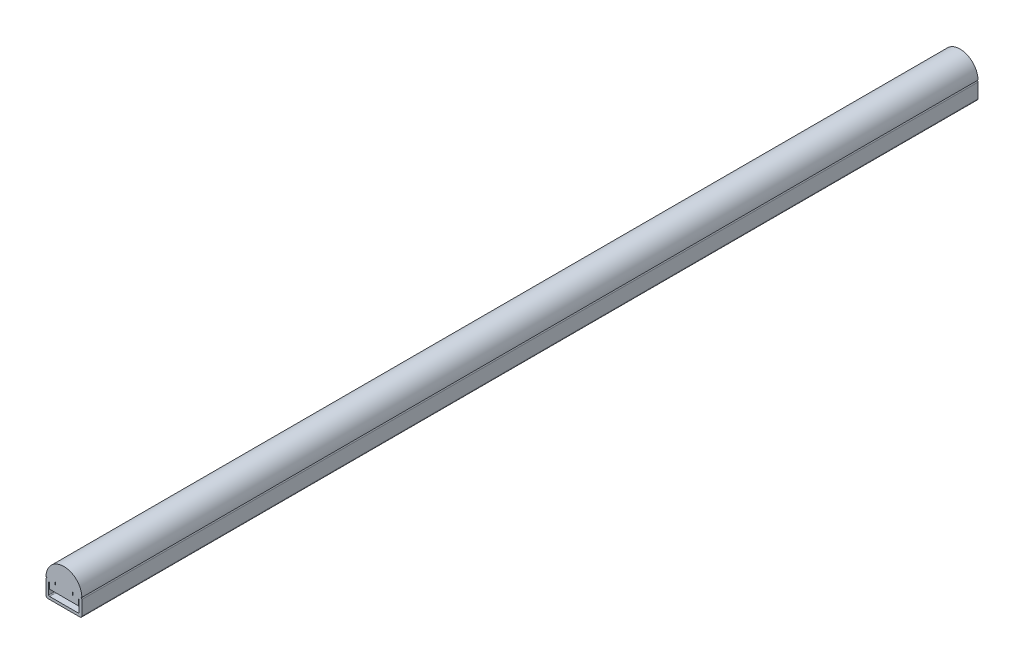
ISO-10303-21;
HEADER;
FILE_DESCRIPTION(('STEP AP214'),'2;1');
FILE_NAME('part.step','',(''),(''),'','','');
FILE_SCHEMA(('AUTOMOTIVE_DESIGN { 1 0 10303 214 1 1 1 1 }'));
ENDSEC;
DATA;
#1=APPLICATION_CONTEXT('core data for automotive mechanical design processes');
#2=APPLICATION_PROTOCOL_DEFINITION('international standard','automotive_design',2000,#1);
#3=PRODUCT_CONTEXT('',#1,'mechanical');
#4=PRODUCT('Part','Part','',(#3));
#5=PRODUCT_RELATED_PRODUCT_CATEGORY('part','',(#4));
#6=PRODUCT_DEFINITION_FORMATION('','',#4);
#7=PRODUCT_DEFINITION_CONTEXT('part definition',#1,'design');
#8=PRODUCT_DEFINITION('design','',#6,#7);
#9=PRODUCT_DEFINITION_SHAPE('','',#8);
#10=(LENGTH_UNIT() NAMED_UNIT(*) SI_UNIT(.MILLI.,.METRE.));
#11=(NAMED_UNIT(*) PLANE_ANGLE_UNIT() SI_UNIT($,.RADIAN.));
#12=(NAMED_UNIT(*) SI_UNIT($,.STERADIAN.) SOLID_ANGLE_UNIT());
#13=UNCERTAINTY_MEASURE_WITH_UNIT(LENGTH_MEASURE(1.E-05),#10,'distance_accuracy_value','');
#14=(GEOMETRIC_REPRESENTATION_CONTEXT(3) GLOBAL_UNCERTAINTY_ASSIGNED_CONTEXT((#13)) GLOBAL_UNIT_ASSIGNED_CONTEXT((#10,
#11,#12)) REPRESENTATION_CONTEXT('',''));
#15=CARTESIAN_POINT('',(0.,0.,0.));
#16=DIRECTION('',(0.,0.,1.));
#17=DIRECTION('',(1.,0.,0.));
#18=AXIS2_PLACEMENT_3D('',#15,#16,#17);
#19=CARTESIAN_POINT('',(9.,1.00000000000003,0.));
#20=DIRECTION('',(0.,0.,1.));
#21=DIRECTION('',(1.,0.,0.));
#22=AXIS2_PLACEMENT_3D('',#19,#20,#21);
#23=CYLINDRICAL_SURFACE('',#22,1.00000000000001);
#24=DIRECTION('',(0.,0.,1.));
#25=VECTOR('',#24,1.);
#26=CARTESIAN_POINT('',(9.,0.,0.));
#27=LINE('',#26,#25);
#28=CARTESIAN_POINT('',(9.,0.,0.));
#29=VERTEX_POINT('',#28);
#30=CARTESIAN_POINT('',(9.,0.,500.));
#31=VERTEX_POINT('',#30);
#32=EDGE_CURVE('E9',#29,#31,#27,.T.);
#33=ORIENTED_EDGE('',*,*,#32,.F.);
#34=CARTESIAN_POINT('',(9.,1.00000000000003,0.));
#35=DIRECTION('',(0.,0.,1.));
#36=DIRECTION('',(1.,0.,0.));
#37=AXIS2_PLACEMENT_3D('',#34,#35,#36);
#38=CIRCLE('',#37,1.00000000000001);
#39=CARTESIAN_POINT('',(10.,1.00000000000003,0.));
#40=VERTEX_POINT('',#39);
#41=EDGE_CURVE('E375',#29,#40,#38,.T.);
#42=ORIENTED_EDGE('',*,*,#41,.T.);
#43=DIRECTION('',(0.,0.,1.));
#44=VECTOR('',#43,1.);
#45=CARTESIAN_POINT('',(10.,1.00000000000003,0.));
#46=LINE('',#45,#44);
#47=CARTESIAN_POINT('',(10.,1.00000000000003,500.));
#48=VERTEX_POINT('',#47);
#49=EDGE_CURVE('E405',#40,#48,#46,.T.);
#50=ORIENTED_EDGE('',*,*,#49,.T.);
#51=CARTESIAN_POINT('',(9.,1.00000000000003,500.));
#52=DIRECTION('',(0.,0.,1.));
#53=DIRECTION('',(1.,0.,0.));
#54=AXIS2_PLACEMENT_3D('',#51,#52,#53);
#55=CIRCLE('',#54,1.00000000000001);
#56=EDGE_CURVE('E345',#31,#48,#55,.T.);
#57=ORIENTED_EDGE('',*,*,#56,.F.);
#58=EDGE_LOOP('',(#33,#42,#50,#57));
#59=FACE_BOUND('',#58,.T.);
#60=ADVANCED_FACE('F14',(#59),#23,.T.);
#61=CARTESIAN_POINT('',(9.,0.,0.));
#62=DIRECTION('',(0.,1.,0.));
#63=DIRECTION('',(0.,0.,1.));
#64=AXIS2_PLACEMENT_3D('',#61,#62,#63);
#65=PLANE('',#64);
#66=DIRECTION('',(0.,0.,1.));
#67=VECTOR('',#66,1.);
#68=CARTESIAN_POINT('',(-9.,0.,0.));
#69=LINE('',#68,#67);
#70=CARTESIAN_POINT('',(-9.,0.,0.));
#71=VERTEX_POINT('',#70);
#72=CARTESIAN_POINT('',(-9.,0.,500.));
#73=VERTEX_POINT('',#72);
#74=EDGE_CURVE('E22',#71,#73,#69,.T.);
#75=ORIENTED_EDGE('',*,*,#74,.F.);
#76=DIRECTION('',(-1.,0.,0.));
#77=VECTOR('',#76,1.);
#78=CARTESIAN_POINT('',(9.,0.,0.));
#79=LINE('',#78,#77);
#80=EDGE_CURVE('E402',#29,#71,#79,.T.);
#81=ORIENTED_EDGE('',*,*,#80,.F.);
#82=ORIENTED_EDGE('',*,*,#32,.T.);
#83=DIRECTION('',(-1.,0.,0.));
#84=VECTOR('',#83,1.);
#85=CARTESIAN_POINT('',(9.,0.,500.));
#86=LINE('',#85,#84);
#87=EDGE_CURVE('E372',#31,#73,#86,.T.);
#88=ORIENTED_EDGE('',*,*,#87,.T.);
#89=EDGE_LOOP('',(#75,#81,#82,#88));
#90=FACE_BOUND('',#89,.T.);
#91=ADVANCED_FACE('F16',(#90),#65,.F.);
#92=CARTESIAN_POINT('',(-9.,1.00000000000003,0.));
#93=DIRECTION('',(0.,0.,1.));
#94=DIRECTION('',(1.,0.,0.));
#95=AXIS2_PLACEMENT_3D('',#92,#93,#94);
#96=CYLINDRICAL_SURFACE('',#95,1.00000000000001);
#97=DIRECTION('',(0.,0.,1.));
#98=VECTOR('',#97,1.);
#99=CARTESIAN_POINT('',(-10.,1.00000000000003,0.));
#100=LINE('',#99,#98);
#101=CARTESIAN_POINT('',(-10.,1.00000000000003,0.));
#102=VERTEX_POINT('',#101);
#103=CARTESIAN_POINT('',(-10.,1.00000000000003,500.));
#104=VERTEX_POINT('',#103);
#105=EDGE_CURVE('E419',#102,#104,#100,.T.);
#106=ORIENTED_EDGE('',*,*,#105,.F.);
#107=CARTESIAN_POINT('',(-9.,1.00000000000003,0.));
#108=DIRECTION('',(0.,0.,1.));
#109=DIRECTION('',(1.,0.,0.));
#110=AXIS2_PLACEMENT_3D('',#107,#108,#109);
#111=CIRCLE('',#110,1.00000000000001);
#112=EDGE_CURVE('E399',#102,#71,#111,.T.);
#113=ORIENTED_EDGE('',*,*,#112,.T.);
#114=ORIENTED_EDGE('',*,*,#74,.T.);
#115=CARTESIAN_POINT('',(-9.,1.00000000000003,500.));
#116=DIRECTION('',(0.,0.,1.));
#117=DIRECTION('',(1.,0.,0.));
#118=AXIS2_PLACEMENT_3D('',#115,#116,#117);
#119=CIRCLE('',#118,1.00000000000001);
#120=EDGE_CURVE('E369',#104,#73,#119,.T.);
#121=ORIENTED_EDGE('',*,*,#120,.F.);
#122=EDGE_LOOP('',(#106,#113,#114,#121));
#123=FACE_BOUND('',#122,.T.);
#124=ADVANCED_FACE('F422',(#123),#96,.T.);
#125=CARTESIAN_POINT('',(-10.,9.,0.));
#126=DIRECTION('',(-1.,0.,0.));
#127=DIRECTION('',(0.,0.,1.));
#128=AXIS2_PLACEMENT_3D('',#125,#126,#127);
#129=PLANE('',#128);
#130=DIRECTION('',(0.,0.,1.));
#131=VECTOR('',#130,1.);
#132=CARTESIAN_POINT('',(-10.,9.,0.));
#133=LINE('',#132,#131);
#134=CARTESIAN_POINT('',(-10.,9.,0.));
#135=VERTEX_POINT('',#134);
#136=CARTESIAN_POINT('',(-10.,9.,500.));
#137=VERTEX_POINT('',#136);
#138=EDGE_CURVE('E417',#135,#137,#133,.T.);
#139=ORIENTED_EDGE('',*,*,#138,.F.);
#140=DIRECTION('',(0.,-1.,0.));
#141=VECTOR('',#140,1.);
#142=CARTESIAN_POINT('',(-10.,9.,0.));
#143=LINE('',#142,#141);
#144=EDGE_CURVE('E396',#135,#102,#143,.T.);
#145=ORIENTED_EDGE('',*,*,#144,.T.);
#146=ORIENTED_EDGE('',*,*,#105,.T.);
#147=DIRECTION('',(0.,-1.,0.));
#148=VECTOR('',#147,1.);
#149=CARTESIAN_POINT('',(-10.,9.,500.));
#150=LINE('',#149,#148);
#151=EDGE_CURVE('E366',#137,#104,#150,.T.);
#152=ORIENTED_EDGE('',*,*,#151,.F.);
#153=EDGE_LOOP('',(#139,#145,#146,#152));
#154=FACE_BOUND('',#153,.T.);
#155=ADVANCED_FACE('F458',(#154),#129,.T.);
#156=CARTESIAN_POINT('',(-9.,9.,0.));
#157=DIRECTION('',(0.,0.,1.));
#158=DIRECTION('',(1.,0.,0.));
#159=AXIS2_PLACEMENT_3D('',#156,#157,#158);
#160=CYLINDRICAL_SURFACE('',#159,1.);
#161=DIRECTION('',(0.,0.,1.));
#162=VECTOR('',#161,1.);
#163=CARTESIAN_POINT('',(-9.,10.,0.));
#164=LINE('',#163,#162);
#165=CARTESIAN_POINT('',(-9.,10.,0.));
#166=VERTEX_POINT('',#165);
#167=CARTESIAN_POINT('',(-9.,10.,500.));
#168=VERTEX_POINT('',#167);
#169=EDGE_CURVE('E415',#166,#168,#164,.T.);
#170=ORIENTED_EDGE('',*,*,#169,.F.);
#171=CARTESIAN_POINT('',(-9.,9.,0.));
#172=DIRECTION('',(0.,0.,1.));
#173=DIRECTION('',(1.,0.,0.));
#174=AXIS2_PLACEMENT_3D('',#171,#172,#173);
#175=CIRCLE('',#174,1.);
#176=EDGE_CURVE('E393',#166,#135,#175,.T.);
#177=ORIENTED_EDGE('',*,*,#176,.T.);
#178=ORIENTED_EDGE('',*,*,#138,.T.);
#179=CARTESIAN_POINT('',(-9.,9.,500.));
#180=DIRECTION('',(0.,0.,1.));
#181=DIRECTION('',(1.,0.,0.));
#182=AXIS2_PLACEMENT_3D('',#179,#180,#181);
#183=CIRCLE('',#182,1.);
#184=EDGE_CURVE('E363',#168,#137,#183,.T.);
#185=ORIENTED_EDGE('',*,*,#184,.F.);
#186=EDGE_LOOP('',(#170,#177,#178,#185));
#187=FACE_BOUND('',#186,.T.);
#188=ADVANCED_FACE('F455',(#187),#160,.T.);
#189=CARTESIAN_POINT('',(-9.,10.,0.));
#190=DIRECTION('',(0.,1.,0.));
#191=DIRECTION('',(-1.,0.,0.));
#192=AXIS2_PLACEMENT_3D('',#189,#190,#191);
#193=PLANE('',#192);
#194=DIRECTION('',(0.,0.,1.));
#195=VECTOR('',#194,1.);
#196=CARTESIAN_POINT('',(-10.,10.,0.));
#197=LINE('',#196,#195);
#198=CARTESIAN_POINT('',(-10.,10.,0.));
#199=VERTEX_POINT('',#198);
#200=CARTESIAN_POINT('',(-10.,10.,500.));
#201=VERTEX_POINT('',#200);
#202=EDGE_CURVE('E413',#199,#201,#197,.T.);
#203=ORIENTED_EDGE('',*,*,#202,.F.);
#204=DIRECTION('',(-1.,0.,0.));
#205=VECTOR('',#204,1.);
#206=CARTESIAN_POINT('',(-9.,10.,0.));
#207=LINE('',#206,#205);
#208=EDGE_CURVE('E390',#166,#199,#207,.T.);
#209=ORIENTED_EDGE('',*,*,#208,.F.);
#210=ORIENTED_EDGE('',*,*,#169,.T.);
#211=DIRECTION('',(-1.,0.,0.));
#212=VECTOR('',#211,1.);
#213=CARTESIAN_POINT('',(-9.,10.,500.));
#214=LINE('',#213,#212);
#215=EDGE_CURVE('E360',#168,#201,#214,.T.);
#216=ORIENTED_EDGE('',*,*,#215,.T.);
#217=EDGE_LOOP('',(#203,#209,#210,#216));
#218=FACE_BOUND('',#217,.T.);
#219=ADVANCED_FACE('F451',(#218),#193,.F.);
#220=CARTESIAN_POINT('',(0.,10.,0.));
#221=DIRECTION('',(0.,0.,1.));
#222=DIRECTION('',(1.,0.,0.));
#223=AXIS2_PLACEMENT_3D('',#220,#221,#222);
#224=CYLINDRICAL_SURFACE('',#223,10.);
#225=DIRECTION('',(0.,0.,1.));
#226=VECTOR('',#225,1.);
#227=CARTESIAN_POINT('',(10.,10.,0.));
#228=LINE('',#227,#226);
#229=CARTESIAN_POINT('',(10.,10.,0.));
#230=VERTEX_POINT('',#229);
#231=CARTESIAN_POINT('',(10.,10.,500.));
#232=VERTEX_POINT('',#231);
#233=EDGE_CURVE('E411',#230,#232,#228,.T.);
#234=ORIENTED_EDGE('',*,*,#233,.F.);
#235=CARTESIAN_POINT('',(0.,10.,0.));
#236=DIRECTION('',(0.,0.,1.));
#237=DIRECTION('',(1.,0.,0.));
#238=AXIS2_PLACEMENT_3D('',#235,#236,#237);
#239=CIRCLE('',#238,10.);
#240=EDGE_CURVE('E387',#230,#199,#239,.T.);
#241=ORIENTED_EDGE('',*,*,#240,.T.);
#242=ORIENTED_EDGE('',*,*,#202,.T.);
#243=CARTESIAN_POINT('',(0.,10.,500.));
#244=DIRECTION('',(0.,0.,1.));
#245=DIRECTION('',(1.,0.,0.));
#246=AXIS2_PLACEMENT_3D('',#243,#244,#245);
#247=CIRCLE('',#246,10.);
#248=EDGE_CURVE('E357',#232,#201,#247,.T.);
#249=ORIENTED_EDGE('',*,*,#248,.F.);
#250=EDGE_LOOP('',(#234,#241,#242,#249));
#251=FACE_BOUND('',#250,.T.);
#252=ADVANCED_FACE('F447',(#251),#224,.T.);
#253=CARTESIAN_POINT('',(10.,10.,0.));
#254=DIRECTION('',(0.,1.,0.));
#255=DIRECTION('',(-1.,0.,0.));
#256=AXIS2_PLACEMENT_3D('',#253,#254,#255);
#257=PLANE('',#256);
#258=DIRECTION('',(0.,0.,1.));
#259=VECTOR('',#258,1.);
#260=CARTESIAN_POINT('',(9.,10.,0.));
#261=LINE('',#260,#259);
#262=CARTESIAN_POINT('',(9.,10.,0.));
#263=VERTEX_POINT('',#262);
#264=CARTESIAN_POINT('',(9.,10.,500.));
#265=VERTEX_POINT('',#264);
#266=EDGE_CURVE('E409',#263,#265,#261,.T.);
#267=ORIENTED_EDGE('',*,*,#266,.F.);
#268=DIRECTION('',(-1.,0.,0.));
#269=VECTOR('',#268,1.);
#270=CARTESIAN_POINT('',(10.,10.,0.));
#271=LINE('',#270,#269);
#272=EDGE_CURVE('E384',#230,#263,#271,.T.);
#273=ORIENTED_EDGE('',*,*,#272,.F.);
#274=ORIENTED_EDGE('',*,*,#233,.T.);
#275=DIRECTION('',(-1.,0.,0.));
#276=VECTOR('',#275,1.);
#277=CARTESIAN_POINT('',(10.,10.,500.));
#278=LINE('',#277,#276);
#279=EDGE_CURVE('E354',#232,#265,#278,.T.);
#280=ORIENTED_EDGE('',*,*,#279,.T.);
#281=EDGE_LOOP('',(#267,#273,#274,#280));
#282=FACE_BOUND('',#281,.T.);
#283=ADVANCED_FACE('F443',(#282),#257,.F.);
#284=CARTESIAN_POINT('',(9.,9.,0.));
#285=DIRECTION('',(0.,0.,1.));
#286=DIRECTION('',(1.,0.,0.));
#287=AXIS2_PLACEMENT_3D('',#284,#285,#286);
#288=CYLINDRICAL_SURFACE('',#287,1.);
#289=DIRECTION('',(0.,0.,1.));
#290=VECTOR('',#289,1.);
#291=CARTESIAN_POINT('',(10.,9.,0.));
#292=LINE('',#291,#290);
#293=CARTESIAN_POINT('',(10.,9.,0.));
#294=VERTEX_POINT('',#293);
#295=CARTESIAN_POINT('',(10.,9.,500.));
#296=VERTEX_POINT('',#295);
#297=EDGE_CURVE('E407',#294,#296,#292,.T.);
#298=ORIENTED_EDGE('',*,*,#297,.F.);
#299=CARTESIAN_POINT('',(9.,9.,0.));
#300=DIRECTION('',(0.,0.,1.));
#301=DIRECTION('',(1.,0.,0.));
#302=AXIS2_PLACEMENT_3D('',#299,#300,#301);
#303=CIRCLE('',#302,1.);
#304=EDGE_CURVE('E381',#294,#263,#303,.T.);
#305=ORIENTED_EDGE('',*,*,#304,.T.);
#306=ORIENTED_EDGE('',*,*,#266,.T.);
#307=CARTESIAN_POINT('',(9.,9.,500.));
#308=DIRECTION('',(0.,0.,1.));
#309=DIRECTION('',(1.,0.,0.));
#310=AXIS2_PLACEMENT_3D('',#307,#308,#309);
#311=CIRCLE('',#310,1.);
#312=EDGE_CURVE('E351',#296,#265,#311,.T.);
#313=ORIENTED_EDGE('',*,*,#312,.F.);
#314=EDGE_LOOP('',(#298,#305,#306,#313));
#315=FACE_BOUND('',#314,.T.);
#316=ADVANCED_FACE('F439',(#315),#288,.T.);
#317=CARTESIAN_POINT('',(10.,9.,0.));
#318=DIRECTION('',(-1.,0.,0.));
#319=DIRECTION('',(0.,0.,1.));
#320=AXIS2_PLACEMENT_3D('',#317,#318,#319);
#321=PLANE('',#320);
#322=DIRECTION('',(0.,-1.,0.));
#323=VECTOR('',#322,1.);
#324=CARTESIAN_POINT('',(10.,9.,0.));
#325=LINE('',#324,#323);
#326=EDGE_CURVE('E378',#294,#40,#325,.T.);
#327=ORIENTED_EDGE('',*,*,#326,.F.);
#328=ORIENTED_EDGE('',*,*,#297,.T.);
#329=DIRECTION('',(0.,-1.,0.));
#330=VECTOR('',#329,1.);
#331=CARTESIAN_POINT('',(10.,9.,500.));
#332=LINE('',#331,#330);
#333=EDGE_CURVE('E348',#296,#48,#332,.T.);
#334=ORIENTED_EDGE('',*,*,#333,.T.);
#335=ORIENTED_EDGE('',*,*,#49,.F.);
#336=EDGE_LOOP('',(#327,#328,#334,#335));
#337=FACE_BOUND('',#336,.T.);
#338=ADVANCED_FACE('F436',(#337),#321,.F.);
#339=CARTESIAN_POINT('',(9.,1.00000000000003,0.));
#340=DIRECTION('',(0.,0.,1.));
#341=DIRECTION('',(1.,0.,0.));
#342=AXIS2_PLACEMENT_3D('',#339,#340,#341);
#343=PLANE('',#342);
#344=DIRECTION('',(0.,-1.,0.));
#345=VECTOR('',#344,1.);
#346=CARTESIAN_POINT('',(-4.75,10.,0.));
#347=LINE('',#346,#345);
#348=CARTESIAN_POINT('',(-4.75,10.,0.));
#349=VERTEX_POINT('',#348);
#350=CARTESIAN_POINT('',(-4.75,8.5,0.));
#351=VERTEX_POINT('',#350);
#352=EDGE_CURVE('E227',#349,#351,#347,.T.);
#353=ORIENTED_EDGE('',*,*,#352,.F.);
#354=DIRECTION('',(-1.,0.,0.));
#355=VECTOR('',#354,1.);
#356=CARTESIAN_POINT('',(-4.75,10.,0.));
#357=LINE('',#356,#355);
#358=CARTESIAN_POINT('',(-5.,10.,0.));
#359=VERTEX_POINT('',#358);
#360=EDGE_CURVE('E218',#349,#359,#357,.T.);
#361=ORIENTED_EDGE('',*,*,#360,.T.);
#362=DIRECTION('',(0.,-1.,0.));
#363=VECTOR('',#362,1.);
#364=CARTESIAN_POINT('',(-5.,10.,0.));
#365=LINE('',#364,#363);
#366=CARTESIAN_POINT('',(-5.,8.5,0.));
#367=VERTEX_POINT('',#366);
#368=EDGE_CURVE('E224',#359,#367,#365,.T.);
#369=ORIENTED_EDGE('',*,*,#368,.T.);
#370=DIRECTION('',(-1.,0.,0.));
#371=VECTOR('',#370,1.);
#372=CARTESIAN_POINT('',(-4.75,8.5,0.));
#373=LINE('',#372,#371);
#374=EDGE_CURVE('E29',#351,#367,#373,.T.);
#375=ORIENTED_EDGE('',*,*,#374,.F.);
#376=EDGE_LOOP('',(#353,#361,#369,#375));
#377=FACE_BOUND('',#376,.T.);
#378=DIRECTION('',(0.,-1.,0.));
#379=VECTOR('',#378,1.);
#380=CARTESIAN_POINT('',(8.5,8.,0.));
#381=LINE('',#380,#379);
#382=CARTESIAN_POINT('',(8.5,8.,0.));
#383=VERTEX_POINT('',#382);
#384=CARTESIAN_POINT('',(8.5,2.00000000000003,0.));
#385=VERTEX_POINT('',#384);
#386=EDGE_CURVE('E290',#383,#385,#381,.T.);
#387=ORIENTED_EDGE('',*,*,#386,.F.);
#388=CARTESIAN_POINT('',(8.,8.,0.));
#389=DIRECTION('',(0.,0.,1.));
#390=DIRECTION('',(1.,0.,0.));
#391=AXIS2_PLACEMENT_3D('',#388,#389,#390);
#392=CIRCLE('',#391,0.5);
#393=CARTESIAN_POINT('',(8.,8.5,0.));
#394=VERTEX_POINT('',#393);
#395=EDGE_CURVE('E263',#383,#394,#392,.T.);
#396=ORIENTED_EDGE('',*,*,#395,.T.);
#397=DIRECTION('',(0.,1.,0.));
#398=VECTOR('',#397,1.);
#399=CARTESIAN_POINT('',(8.,5.00000000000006,0.));
#400=LINE('',#399,#398);
#401=CARTESIAN_POINT('',(8.,5.00000000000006,0.));
#402=VERTEX_POINT('',#401);
#403=EDGE_CURVE('E266',#402,#394,#400,.T.);
#404=ORIENTED_EDGE('',*,*,#403,.F.);
#405=DIRECTION('',(-1.,0.,0.));
#406=VECTOR('',#405,1.);
#407=CARTESIAN_POINT('',(8.,5.00000000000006,0.));
#408=LINE('',#407,#406);
#409=CARTESIAN_POINT('',(-8.,5.00000000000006,0.));
#410=VERTEX_POINT('',#409);
#411=EDGE_CURVE('E269',#402,#410,#408,.T.);
#412=ORIENTED_EDGE('',*,*,#411,.T.);
#413=DIRECTION('',(0.,1.,0.));
#414=VECTOR('',#413,1.);
#415=CARTESIAN_POINT('',(-8.,5.00000000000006,0.));
#416=LINE('',#415,#414);
#417=CARTESIAN_POINT('',(-8.,8.5,0.));
#418=VERTEX_POINT('',#417);
#419=EDGE_CURVE('E272',#410,#418,#416,.T.);
#420=ORIENTED_EDGE('',*,*,#419,.T.);
#421=CARTESIAN_POINT('',(-8.,8.,0.));
#422=DIRECTION('',(0.,0.,1.));
#423=DIRECTION('',(1.,0.,0.));
#424=AXIS2_PLACEMENT_3D('',#421,#422,#423);
#425=CIRCLE('',#424,0.5);
#426=CARTESIAN_POINT('',(-8.5,8.,0.));
#427=VERTEX_POINT('',#426);
#428=EDGE_CURVE('E275',#418,#427,#425,.T.);
#429=ORIENTED_EDGE('',*,*,#428,.T.);
#430=DIRECTION('',(0.,-1.,0.));
#431=VECTOR('',#430,1.);
#432=CARTESIAN_POINT('',(-8.5,8.,0.));
#433=LINE('',#432,#431);
#434=CARTESIAN_POINT('',(-8.5,2.00000000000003,0.));
#435=VERTEX_POINT('',#434);
#436=EDGE_CURVE('E278',#427,#435,#433,.T.);
#437=ORIENTED_EDGE('',*,*,#436,.T.);
#438=CARTESIAN_POINT('',(-8.,2.00000000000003,0.));
#439=DIRECTION('',(0.,0.,1.));
#440=DIRECTION('',(1.,0.,0.));
#441=AXIS2_PLACEMENT_3D('',#438,#439,#440);
#442=CIRCLE('',#441,0.5);
#443=CARTESIAN_POINT('',(-8.,1.50000000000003,0.));
#444=VERTEX_POINT('',#443);
#445=EDGE_CURVE('E281',#435,#444,#442,.T.);
#446=ORIENTED_EDGE('',*,*,#445,.T.);
#447=DIRECTION('',(-1.,0.,0.));
#448=VECTOR('',#447,1.);
#449=CARTESIAN_POINT('',(8.,1.50000000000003,0.));
#450=LINE('',#449,#448);
#451=CARTESIAN_POINT('',(8.,1.50000000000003,0.));
#452=VERTEX_POINT('',#451);
#453=EDGE_CURVE('E284',#452,#444,#450,.T.);
#454=ORIENTED_EDGE('',*,*,#453,.F.);
#455=CARTESIAN_POINT('',(8.,2.00000000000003,0.));
#456=DIRECTION('',(0.,0.,1.));
#457=DIRECTION('',(1.,0.,0.));
#458=AXIS2_PLACEMENT_3D('',#455,#456,#457);
#459=CIRCLE('',#458,0.5);
#460=EDGE_CURVE('E287',#452,#385,#459,.T.);
#461=ORIENTED_EDGE('',*,*,#460,.T.);
#462=EDGE_LOOP('',(#387,#396,#404,#412,#420,#429,#437,#446,#454,#461));
#463=FACE_BOUND('',#462,.T.);
#464=DIRECTION('',(-1.,0.,0.));
#465=VECTOR('',#464,1.);
#466=CARTESIAN_POINT('',(5.00000000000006,10.,0.));
#467=LINE('',#466,#465);
#468=CARTESIAN_POINT('',(5.00000000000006,10.,0.));
#469=VERTEX_POINT('',#468);
#470=CARTESIAN_POINT('',(4.75,10.,0.));
#471=VERTEX_POINT('',#470);
#472=EDGE_CURVE('E333',#469,#471,#467,.T.);
#473=ORIENTED_EDGE('',*,*,#472,.T.);
#474=DIRECTION('',(0.,-1.,0.));
#475=VECTOR('',#474,1.);
#476=CARTESIAN_POINT('',(4.75,10.,0.));
#477=LINE('',#476,#475);
#478=CARTESIAN_POINT('',(4.75,8.5,0.));
#479=VERTEX_POINT('',#478);
#480=EDGE_CURVE('E325',#471,#479,#477,.T.);
#481=ORIENTED_EDGE('',*,*,#480,.T.);
#482=DIRECTION('',(-1.,0.,0.));
#483=VECTOR('',#482,1.);
#484=CARTESIAN_POINT('',(5.00000000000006,8.5,0.));
#485=LINE('',#484,#483);
#486=CARTESIAN_POINT('',(5.00000000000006,8.5,0.));
#487=VERTEX_POINT('',#486);
#488=EDGE_CURVE('E328',#487,#479,#485,.T.);
#489=ORIENTED_EDGE('',*,*,#488,.F.);
#490=DIRECTION('',(0.,-1.,0.));
#491=VECTOR('',#490,1.);
#492=CARTESIAN_POINT('',(5.00000000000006,10.,0.));
#493=LINE('',#492,#491);
#494=EDGE_CURVE('E331',#469,#487,#493,.T.);
#495=ORIENTED_EDGE('',*,*,#494,.F.);
#496=EDGE_LOOP('',(#473,#481,#489,#495));
#497=FACE_BOUND('',#496,.T.);
#498=ORIENTED_EDGE('',*,*,#41,.F.);
#499=ORIENTED_EDGE('',*,*,#80,.T.);
#500=ORIENTED_EDGE('',*,*,#112,.F.);
#501=ORIENTED_EDGE('',*,*,#144,.F.);
#502=ORIENTED_EDGE('',*,*,#176,.F.);
#503=ORIENTED_EDGE('',*,*,#208,.T.);
#504=ORIENTED_EDGE('',*,*,#240,.F.);
#505=ORIENTED_EDGE('',*,*,#272,.T.);
#506=ORIENTED_EDGE('',*,*,#304,.F.);
#507=ORIENTED_EDGE('',*,*,#326,.T.);
#508=EDGE_LOOP('',(#498,#499,#500,#501,#502,#503,#504,#505,#506,#507));
#509=FACE_BOUND('',#508,.T.);
#510=ADVANCED_FACE('F460',(#377,#463,#497,#509),#343,.F.);
#511=CARTESIAN_POINT('',(9.,1.00000000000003,500.));
#512=DIRECTION('',(0.,0.,1.));
#513=DIRECTION('',(1.,0.,0.));
#514=AXIS2_PLACEMENT_3D('',#511,#512,#513);
#515=PLANE('',#514);
#516=DIRECTION('',(-1.,0.,0.));
#517=VECTOR('',#516,1.);
#518=CARTESIAN_POINT('',(-4.75,10.,500.));
#519=LINE('',#518,#517);
#520=CARTESIAN_POINT('',(-4.75,10.,500.));
#521=VERTEX_POINT('',#520);
#522=CARTESIAN_POINT('',(-5.,10.,500.));
#523=VERTEX_POINT('',#522);
#524=EDGE_CURVE('E37',#521,#523,#519,.T.);
#525=ORIENTED_EDGE('',*,*,#524,.F.);
#526=DIRECTION('',(0.,-1.,0.));
#527=VECTOR('',#526,1.);
#528=CARTESIAN_POINT('',(-4.75,10.,500.));
#529=LINE('',#528,#527);
#530=CARTESIAN_POINT('',(-4.75,8.5,500.));
#531=VERTEX_POINT('',#530);
#532=EDGE_CURVE('E216',#521,#531,#529,.T.);
#533=ORIENTED_EDGE('',*,*,#532,.T.);
#534=DIRECTION('',(-1.,0.,0.));
#535=VECTOR('',#534,1.);
#536=CARTESIAN_POINT('',(-4.75,8.5,500.));
#537=LINE('',#536,#535);
#538=CARTESIAN_POINT('',(-5.,8.5,500.));
#539=VERTEX_POINT('',#538);
#540=EDGE_CURVE('E200',#531,#539,#537,.T.);
#541=ORIENTED_EDGE('',*,*,#540,.T.);
#542=DIRECTION('',(0.,-1.,0.));
#543=VECTOR('',#542,1.);
#544=CARTESIAN_POINT('',(-5.,10.,500.));
#545=LINE('',#544,#543);
#546=EDGE_CURVE('E209',#523,#539,#545,.T.);
#547=ORIENTED_EDGE('',*,*,#546,.F.);
#548=EDGE_LOOP('',(#525,#533,#541,#547));
#549=FACE_BOUND('',#548,.T.);
#550=CARTESIAN_POINT('',(8.,8.,500.));
#551=DIRECTION('',(0.,0.,1.));
#552=DIRECTION('',(1.,0.,0.));
#553=AXIS2_PLACEMENT_3D('',#550,#551,#552);
#554=CIRCLE('',#553,0.5);
#555=CARTESIAN_POINT('',(8.5,8.,500.));
#556=VERTEX_POINT('',#555);
#557=CARTESIAN_POINT('',(8.,8.5,500.));
#558=VERTEX_POINT('',#557);
#559=EDGE_CURVE('E234',#556,#558,#554,.T.);
#560=ORIENTED_EDGE('',*,*,#559,.F.);
#561=DIRECTION('',(0.,-1.,0.));
#562=VECTOR('',#561,1.);
#563=CARTESIAN_POINT('',(8.5,8.,500.));
#564=LINE('',#563,#562);
#565=CARTESIAN_POINT('',(8.5,2.00000000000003,500.));
#566=VERTEX_POINT('',#565);
#567=EDGE_CURVE('E260',#556,#566,#564,.T.);
#568=ORIENTED_EDGE('',*,*,#567,.T.);
#569=CARTESIAN_POINT('',(8.,2.00000000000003,500.));
#570=DIRECTION('',(0.,0.,1.));
#571=DIRECTION('',(1.,0.,0.));
#572=AXIS2_PLACEMENT_3D('',#569,#570,#571);
#573=CIRCLE('',#572,0.5);
#574=CARTESIAN_POINT('',(8.,1.50000000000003,500.));
#575=VERTEX_POINT('',#574);
#576=EDGE_CURVE('E257',#575,#566,#573,.T.);
#577=ORIENTED_EDGE('',*,*,#576,.F.);
#578=DIRECTION('',(-1.,0.,0.));
#579=VECTOR('',#578,1.);
#580=CARTESIAN_POINT('',(8.,1.50000000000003,500.));
#581=LINE('',#580,#579);
#582=CARTESIAN_POINT('',(-8.,1.50000000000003,500.));
#583=VERTEX_POINT('',#582);
#584=EDGE_CURVE('E254',#575,#583,#581,.T.);
#585=ORIENTED_EDGE('',*,*,#584,.T.);
#586=CARTESIAN_POINT('',(-8.,2.00000000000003,500.));
#587=DIRECTION('',(0.,0.,1.));
#588=DIRECTION('',(1.,0.,0.));
#589=AXIS2_PLACEMENT_3D('',#586,#587,#588);
#590=CIRCLE('',#589,0.5);
#591=CARTESIAN_POINT('',(-8.5,2.00000000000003,500.));
#592=VERTEX_POINT('',#591);
#593=EDGE_CURVE('E251',#592,#583,#590,.T.);
#594=ORIENTED_EDGE('',*,*,#593,.F.);
#595=DIRECTION('',(0.,-1.,0.));
#596=VECTOR('',#595,1.);
#597=CARTESIAN_POINT('',(-8.5,8.,500.));
#598=LINE('',#597,#596);
#599=CARTESIAN_POINT('',(-8.5,8.,500.));
#600=VERTEX_POINT('',#599);
#601=EDGE_CURVE('E248',#600,#592,#598,.T.);
#602=ORIENTED_EDGE('',*,*,#601,.F.);
#603=CARTESIAN_POINT('',(-8.,8.,500.));
#604=DIRECTION('',(0.,0.,1.));
#605=DIRECTION('',(1.,0.,0.));
#606=AXIS2_PLACEMENT_3D('',#603,#604,#605);
#607=CIRCLE('',#606,0.5);
#608=CARTESIAN_POINT('',(-8.,8.5,500.));
#609=VERTEX_POINT('',#608);
#610=EDGE_CURVE('E245',#609,#600,#607,.T.);
#611=ORIENTED_EDGE('',*,*,#610,.F.);
#612=DIRECTION('',(0.,1.,0.));
#613=VECTOR('',#612,1.);
#614=CARTESIAN_POINT('',(-8.,5.00000000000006,500.));
#615=LINE('',#614,#613);
#616=CARTESIAN_POINT('',(-8.,5.00000000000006,500.));
#617=VERTEX_POINT('',#616);
#618=EDGE_CURVE('E242',#617,#609,#615,.T.);
#619=ORIENTED_EDGE('',*,*,#618,.F.);
#620=DIRECTION('',(-1.,0.,0.));
#621=VECTOR('',#620,1.);
#622=CARTESIAN_POINT('',(8.,5.00000000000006,500.));
#623=LINE('',#622,#621);
#624=CARTESIAN_POINT('',(8.,5.00000000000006,500.));
#625=VERTEX_POINT('',#624);
#626=EDGE_CURVE('E239',#625,#617,#623,.T.);
#627=ORIENTED_EDGE('',*,*,#626,.F.);
#628=DIRECTION('',(0.,1.,0.));
#629=VECTOR('',#628,1.);
#630=CARTESIAN_POINT('',(8.,5.00000000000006,500.));
#631=LINE('',#630,#629);
#632=EDGE_CURVE('E236',#625,#558,#631,.T.);
#633=ORIENTED_EDGE('',*,*,#632,.T.);
#634=EDGE_LOOP('',(#560,#568,#577,#585,#594,#602,#611,#619,#627,#633));
#635=FACE_BOUND('',#634,.T.);
#636=DIRECTION('',(0.,-1.,0.));
#637=VECTOR('',#636,1.);
#638=CARTESIAN_POINT('',(4.75,10.,500.));
#639=LINE('',#638,#637);
#640=CARTESIAN_POINT('',(4.75,10.,500.));
#641=VERTEX_POINT('',#640);
#642=CARTESIAN_POINT('',(4.75,8.5,500.));
#643=VERTEX_POINT('',#642);
#644=EDGE_CURVE('E314',#641,#643,#639,.T.);
#645=ORIENTED_EDGE('',*,*,#644,.F.);
#646=DIRECTION('',(-1.,0.,0.));
#647=VECTOR('',#646,1.);
#648=CARTESIAN_POINT('',(5.00000000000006,10.,500.));
#649=LINE('',#648,#647);
#650=CARTESIAN_POINT('',(5.00000000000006,10.,500.));
#651=VERTEX_POINT('',#650);
#652=EDGE_CURVE('E322',#651,#641,#649,.T.);
#653=ORIENTED_EDGE('',*,*,#652,.F.);
#654=DIRECTION('',(0.,-1.,0.));
#655=VECTOR('',#654,1.);
#656=CARTESIAN_POINT('',(5.00000000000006,10.,500.));
#657=LINE('',#656,#655);
#658=CARTESIAN_POINT('',(5.00000000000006,8.5,500.));
#659=VERTEX_POINT('',#658);
#660=EDGE_CURVE('E319',#651,#659,#657,.T.);
#661=ORIENTED_EDGE('',*,*,#660,.T.);
#662=DIRECTION('',(-1.,0.,0.));
#663=VECTOR('',#662,1.);
#664=CARTESIAN_POINT('',(5.00000000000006,8.5,500.));
#665=LINE('',#664,#663);
#666=EDGE_CURVE('E316',#659,#643,#665,.T.);
#667=ORIENTED_EDGE('',*,*,#666,.T.);
#668=EDGE_LOOP('',(#645,#653,#661,#667));
#669=FACE_BOUND('',#668,.T.);
#670=ORIENTED_EDGE('',*,*,#56,.T.);
#671=ORIENTED_EDGE('',*,*,#333,.F.);
#672=ORIENTED_EDGE('',*,*,#312,.T.);
#673=ORIENTED_EDGE('',*,*,#279,.F.);
#674=ORIENTED_EDGE('',*,*,#248,.T.);
#675=ORIENTED_EDGE('',*,*,#215,.F.);
#676=ORIENTED_EDGE('',*,*,#184,.T.);
#677=ORIENTED_EDGE('',*,*,#151,.T.);
#678=ORIENTED_EDGE('',*,*,#120,.T.);
#679=ORIENTED_EDGE('',*,*,#87,.F.);
#680=EDGE_LOOP('',(#670,#671,#672,#673,#674,#675,#676,#677,#678,#679));
#681=FACE_BOUND('',#680,.T.);
#682=ADVANCED_FACE('F213',(#549,#635,#669,#681),#515,.T.);
#683=CARTESIAN_POINT('',(4.75,10.,0.));
#684=DIRECTION('',(-1.,0.,0.));
#685=DIRECTION('',(0.,0.,1.));
#686=AXIS2_PLACEMENT_3D('',#683,#684,#685);
#687=PLANE('',#686);
#688=DIRECTION('',(0.,0.,1.));
#689=VECTOR('',#688,1.);
#690=CARTESIAN_POINT('',(4.75,10.,0.));
#691=LINE('',#690,#689);
#692=EDGE_CURVE('E343',#471,#641,#691,.T.);
#693=ORIENTED_EDGE('',*,*,#692,.T.);
#694=ORIENTED_EDGE('',*,*,#644,.T.);
#695=DIRECTION('',(0.,0.,1.));
#696=VECTOR('',#695,1.);
#697=CARTESIAN_POINT('',(4.75,8.5,0.));
#698=LINE('',#697,#696);
#699=EDGE_CURVE('E336',#479,#643,#698,.T.);
#700=ORIENTED_EDGE('',*,*,#699,.F.);
#701=ORIENTED_EDGE('',*,*,#480,.F.);
#702=EDGE_LOOP('',(#693,#694,#700,#701));
#703=FACE_BOUND('',#702,.T.);
#704=ADVANCED_FACE('F470',(#703),#687,.F.);
#705=CARTESIAN_POINT('',(5.00000000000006,10.,0.));
#706=DIRECTION('',(0.,1.,0.));
#707=DIRECTION('',(0.,0.,1.));
#708=AXIS2_PLACEMENT_3D('',#705,#706,#707);
#709=PLANE('',#708);
#710=DIRECTION('',(0.,0.,1.));
#711=VECTOR('',#710,1.);
#712=CARTESIAN_POINT('',(5.00000000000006,10.,0.));
#713=LINE('',#712,#711);
#714=EDGE_CURVE('E341',#469,#651,#713,.T.);
#715=ORIENTED_EDGE('',*,*,#714,.T.);
#716=ORIENTED_EDGE('',*,*,#652,.T.);
#717=ORIENTED_EDGE('',*,*,#692,.F.);
#718=ORIENTED_EDGE('',*,*,#472,.F.);
#719=EDGE_LOOP('',(#715,#716,#717,#718));
#720=FACE_BOUND('',#719,.T.);
#721=ADVANCED_FACE('F560',(#720),#709,.F.);
#722=CARTESIAN_POINT('',(5.00000000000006,10.,0.));
#723=DIRECTION('',(-1.,0.,0.));
#724=DIRECTION('',(0.,0.,1.));
#725=AXIS2_PLACEMENT_3D('',#722,#723,#724);
#726=PLANE('',#725);
#727=DIRECTION('',(0.,0.,1.));
#728=VECTOR('',#727,1.);
#729=CARTESIAN_POINT('',(5.00000000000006,8.5,0.));
#730=LINE('',#729,#728);
#731=EDGE_CURVE('E339',#487,#659,#730,.T.);
#732=ORIENTED_EDGE('',*,*,#731,.T.);
#733=ORIENTED_EDGE('',*,*,#660,.F.);
#734=ORIENTED_EDGE('',*,*,#714,.F.);
#735=ORIENTED_EDGE('',*,*,#494,.T.);
#736=EDGE_LOOP('',(#732,#733,#734,#735));
#737=FACE_BOUND('',#736,.T.);
#738=ADVANCED_FACE('F568',(#737),#726,.T.);
#739=CARTESIAN_POINT('',(5.00000000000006,8.5,0.));
#740=DIRECTION('',(0.,1.,0.));
#741=DIRECTION('',(0.,0.,1.));
#742=AXIS2_PLACEMENT_3D('',#739,#740,#741);
#743=PLANE('',#742);
#744=ORIENTED_EDGE('',*,*,#488,.T.);
#745=ORIENTED_EDGE('',*,*,#699,.T.);
#746=ORIENTED_EDGE('',*,*,#666,.F.);
#747=ORIENTED_EDGE('',*,*,#731,.F.);
#748=EDGE_LOOP('',(#744,#745,#746,#747));
#749=FACE_BOUND('',#748,.T.);
#750=ADVANCED_FACE('F577',(#749),#743,.T.);
#751=CARTESIAN_POINT('',(8.,8.,0.));
#752=DIRECTION('',(0.,0.,1.));
#753=DIRECTION('',(1.,0.,0.));
#754=AXIS2_PLACEMENT_3D('',#751,#752,#753);
#755=CYLINDRICAL_SURFACE('',#754,0.5);
#756=DIRECTION('',(0.,0.,1.));
#757=VECTOR('',#756,1.);
#758=CARTESIAN_POINT('',(8.5,8.,0.));
#759=LINE('',#758,#757);
#760=EDGE_CURVE('E312',#383,#556,#759,.T.);
#761=ORIENTED_EDGE('',*,*,#760,.T.);
#762=ORIENTED_EDGE('',*,*,#559,.T.);
#763=DIRECTION('',(0.,0.,1.));
#764=VECTOR('',#763,1.);
#765=CARTESIAN_POINT('',(8.,8.5,0.));
#766=LINE('',#765,#764);
#767=EDGE_CURVE('E293',#394,#558,#766,.T.);
#768=ORIENTED_EDGE('',*,*,#767,.F.);
#769=ORIENTED_EDGE('',*,*,#395,.F.);
#770=EDGE_LOOP('',(#761,#762,#768,#769));
#771=FACE_BOUND('',#770,.T.);
#772=ADVANCED_FACE('F586',(#771),#755,.F.);
#773=CARTESIAN_POINT('',(8.5,8.,0.));
#774=DIRECTION('',(-1.,0.,0.));
#775=DIRECTION('',(0.,0.,1.));
#776=AXIS2_PLACEMENT_3D('',#773,#774,#775);
#777=PLANE('',#776);
#778=DIRECTION('',(0.,0.,1.));
#779=VECTOR('',#778,1.);
#780=CARTESIAN_POINT('',(8.5,2.00000000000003,0.));
#781=LINE('',#780,#779);
#782=EDGE_CURVE('E310',#385,#566,#781,.T.);
#783=ORIENTED_EDGE('',*,*,#782,.T.);
#784=ORIENTED_EDGE('',*,*,#567,.F.);
#785=ORIENTED_EDGE('',*,*,#760,.F.);
#786=ORIENTED_EDGE('',*,*,#386,.T.);
#787=EDGE_LOOP('',(#783,#784,#785,#786));
#788=FACE_BOUND('',#787,.T.);
#789=ADVANCED_FACE('F595',(#788),#777,.T.);
#790=CARTESIAN_POINT('',(8.,2.00000000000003,0.));
#791=DIRECTION('',(0.,0.,1.));
#792=DIRECTION('',(1.,0.,0.));
#793=AXIS2_PLACEMENT_3D('',#790,#791,#792);
#794=CYLINDRICAL_SURFACE('',#793,0.5);
#795=DIRECTION('',(0.,0.,1.));
#796=VECTOR('',#795,1.);
#797=CARTESIAN_POINT('',(8.,1.50000000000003,0.));
#798=LINE('',#797,#796);
#799=EDGE_CURVE('E308',#452,#575,#798,.T.);
#800=ORIENTED_EDGE('',*,*,#799,.T.);
#801=ORIENTED_EDGE('',*,*,#576,.T.);
#802=ORIENTED_EDGE('',*,*,#782,.F.);
#803=ORIENTED_EDGE('',*,*,#460,.F.);
#804=EDGE_LOOP('',(#800,#801,#802,#803));
#805=FACE_BOUND('',#804,.T.);
#806=ADVANCED_FACE('F604',(#805),#794,.F.);
#807=CARTESIAN_POINT('',(8.,1.50000000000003,0.));
#808=DIRECTION('',(0.,1.,0.));
#809=DIRECTION('',(0.,0.,1.));
#810=AXIS2_PLACEMENT_3D('',#807,#808,#809);
#811=PLANE('',#810);
#812=DIRECTION('',(0.,0.,1.));
#813=VECTOR('',#812,1.);
#814=CARTESIAN_POINT('',(-8.,1.50000000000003,0.));
#815=LINE('',#814,#813);
#816=EDGE_CURVE('E306',#444,#583,#815,.T.);
#817=ORIENTED_EDGE('',*,*,#816,.T.);
#818=ORIENTED_EDGE('',*,*,#584,.F.);
#819=ORIENTED_EDGE('',*,*,#799,.F.);
#820=ORIENTED_EDGE('',*,*,#453,.T.);
#821=EDGE_LOOP('',(#817,#818,#819,#820));
#822=FACE_BOUND('',#821,.T.);
#823=ADVANCED_FACE('F613',(#822),#811,.T.);
#824=CARTESIAN_POINT('',(-8.,2.00000000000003,0.));
#825=DIRECTION('',(0.,0.,1.));
#826=DIRECTION('',(1.,0.,0.));
#827=AXIS2_PLACEMENT_3D('',#824,#825,#826);
#828=CYLINDRICAL_SURFACE('',#827,0.5);
#829=DIRECTION('',(0.,0.,1.));
#830=VECTOR('',#829,1.);
#831=CARTESIAN_POINT('',(-8.5,2.00000000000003,0.));
#832=LINE('',#831,#830);
#833=EDGE_CURVE('E304',#435,#592,#832,.T.);
#834=ORIENTED_EDGE('',*,*,#833,.T.);
#835=ORIENTED_EDGE('',*,*,#593,.T.);
#836=ORIENTED_EDGE('',*,*,#816,.F.);
#837=ORIENTED_EDGE('',*,*,#445,.F.);
#838=EDGE_LOOP('',(#834,#835,#836,#837));
#839=FACE_BOUND('',#838,.T.);
#840=ADVANCED_FACE('F622',(#839),#828,.F.);
#841=CARTESIAN_POINT('',(-8.5,8.,0.));
#842=DIRECTION('',(-1.,0.,0.));
#843=DIRECTION('',(0.,0.,1.));
#844=AXIS2_PLACEMENT_3D('',#841,#842,#843);
#845=PLANE('',#844);
#846=DIRECTION('',(0.,0.,1.));
#847=VECTOR('',#846,1.);
#848=CARTESIAN_POINT('',(-8.5,8.,0.));
#849=LINE('',#848,#847);
#850=EDGE_CURVE('E302',#427,#600,#849,.T.);
#851=ORIENTED_EDGE('',*,*,#850,.T.);
#852=ORIENTED_EDGE('',*,*,#601,.T.);
#853=ORIENTED_EDGE('',*,*,#833,.F.);
#854=ORIENTED_EDGE('',*,*,#436,.F.);
#855=EDGE_LOOP('',(#851,#852,#853,#854));
#856=FACE_BOUND('',#855,.T.);
#857=ADVANCED_FACE('F631',(#856),#845,.F.);
#858=CARTESIAN_POINT('',(-8.,8.,0.));
#859=DIRECTION('',(0.,0.,1.));
#860=DIRECTION('',(1.,0.,0.));
#861=AXIS2_PLACEMENT_3D('',#858,#859,#860);
#862=CYLINDRICAL_SURFACE('',#861,0.5);
#863=DIRECTION('',(0.,0.,1.));
#864=VECTOR('',#863,1.);
#865=CARTESIAN_POINT('',(-8.,8.5,0.));
#866=LINE('',#865,#864);
#867=EDGE_CURVE('E300',#418,#609,#866,.T.);
#868=ORIENTED_EDGE('',*,*,#867,.T.);
#869=ORIENTED_EDGE('',*,*,#610,.T.);
#870=ORIENTED_EDGE('',*,*,#850,.F.);
#871=ORIENTED_EDGE('',*,*,#428,.F.);
#872=EDGE_LOOP('',(#868,#869,#870,#871));
#873=FACE_BOUND('',#872,.T.);
#874=ADVANCED_FACE('F640',(#873),#862,.F.);
#875=CARTESIAN_POINT('',(-8.,5.00000000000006,0.));
#876=DIRECTION('',(1.,0.,0.));
#877=DIRECTION('',(0.,0.,-1.));
#878=AXIS2_PLACEMENT_3D('',#875,#876,#877);
#879=PLANE('',#878);
#880=DIRECTION('',(0.,0.,1.));
#881=VECTOR('',#880,1.);
#882=CARTESIAN_POINT('',(-8.,5.00000000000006,0.));
#883=LINE('',#882,#881);
#884=EDGE_CURVE('E298',#410,#617,#883,.T.);
#885=ORIENTED_EDGE('',*,*,#884,.T.);
#886=ORIENTED_EDGE('',*,*,#618,.T.);
#887=ORIENTED_EDGE('',*,*,#867,.F.);
#888=ORIENTED_EDGE('',*,*,#419,.F.);
#889=EDGE_LOOP('',(#885,#886,#887,#888));
#890=FACE_BOUND('',#889,.T.);
#891=ADVANCED_FACE('F649',(#890),#879,.F.);
#892=CARTESIAN_POINT('',(8.,5.00000000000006,0.));
#893=DIRECTION('',(0.,1.,0.));
#894=DIRECTION('',(0.,0.,1.));
#895=AXIS2_PLACEMENT_3D('',#892,#893,#894);
#896=PLANE('',#895);
#897=DIRECTION('',(0.,0.,1.));
#898=VECTOR('',#897,1.);
#899=CARTESIAN_POINT('',(8.,5.00000000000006,0.));
#900=LINE('',#899,#898);
#901=EDGE_CURVE('E296',#402,#625,#900,.T.);
#902=ORIENTED_EDGE('',*,*,#901,.T.);
#903=ORIENTED_EDGE('',*,*,#626,.T.);
#904=ORIENTED_EDGE('',*,*,#884,.F.);
#905=ORIENTED_EDGE('',*,*,#411,.F.);
#906=EDGE_LOOP('',(#902,#903,#904,#905));
#907=FACE_BOUND('',#906,.T.);
#908=ADVANCED_FACE('F658',(#907),#896,.F.);
#909=CARTESIAN_POINT('',(8.,5.00000000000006,0.));
#910=DIRECTION('',(1.,0.,0.));
#911=DIRECTION('',(0.,0.,-1.));
#912=AXIS2_PLACEMENT_3D('',#909,#910,#911);
#913=PLANE('',#912);
#914=ORIENTED_EDGE('',*,*,#403,.T.);
#915=ORIENTED_EDGE('',*,*,#767,.T.);
#916=ORIENTED_EDGE('',*,*,#632,.F.);
#917=ORIENTED_EDGE('',*,*,#901,.F.);
#918=EDGE_LOOP('',(#914,#915,#916,#917));
#919=FACE_BOUND('',#918,.T.);
#920=ADVANCED_FACE('F667',(#919),#913,.T.);
#921=CARTESIAN_POINT('',(-4.75,10.,0.));
#922=DIRECTION('',(0.,1.,0.));
#923=DIRECTION('',(0.,0.,1.));
#924=AXIS2_PLACEMENT_3D('',#921,#922,#923);
#925=PLANE('',#924);
#926=DIRECTION('',(0.,0.,1.));
#927=VECTOR('',#926,1.);
#928=CARTESIAN_POINT('',(-4.75,10.,0.));
#929=LINE('',#928,#927);
#930=EDGE_CURVE('E232',#349,#521,#929,.T.);
#931=ORIENTED_EDGE('',*,*,#930,.T.);
#932=ORIENTED_EDGE('',*,*,#524,.T.);
#933=DIRECTION('',(0.,0.,1.));
#934=VECTOR('',#933,1.);
#935=CARTESIAN_POINT('',(-5.,10.,0.));
#936=LINE('',#935,#934);
#937=EDGE_CURVE('E206',#359,#523,#936,.T.);
#938=ORIENTED_EDGE('',*,*,#937,.F.);
#939=ORIENTED_EDGE('',*,*,#360,.F.);
#940=EDGE_LOOP('',(#931,#932,#938,#939));
#941=FACE_BOUND('',#940,.T.);
#942=ADVANCED_FACE('F676',(#941),#925,.F.);
#943=CARTESIAN_POINT('',(-4.75,10.,0.));
#944=DIRECTION('',(-1.,0.,0.));
#945=DIRECTION('',(0.,0.,1.));
#946=AXIS2_PLACEMENT_3D('',#943,#944,#945);
#947=PLANE('',#946);
#948=DIRECTION('',(0.,0.,1.));
#949=VECTOR('',#948,1.);
#950=CARTESIAN_POINT('',(-4.75,8.5,0.));
#951=LINE('',#950,#949);
#952=EDGE_CURVE('E205',#351,#531,#951,.T.);
#953=ORIENTED_EDGE('',*,*,#952,.T.);
#954=ORIENTED_EDGE('',*,*,#532,.F.);
#955=ORIENTED_EDGE('',*,*,#930,.F.);
#956=ORIENTED_EDGE('',*,*,#352,.T.);
#957=EDGE_LOOP('',(#953,#954,#955,#956));
#958=FACE_BOUND('',#957,.T.);
#959=ADVANCED_FACE('F685',(#958),#947,.T.);
#960=CARTESIAN_POINT('',(-4.75,8.5,0.));
#961=DIRECTION('',(0.,1.,0.));
#962=DIRECTION('',(0.,0.,1.));
#963=AXIS2_PLACEMENT_3D('',#960,#961,#962);
#964=PLANE('',#963);
#965=DIRECTION('',(0.,0.,1.));
#966=VECTOR('',#965,1.);
#967=CARTESIAN_POINT('',(-5.,8.5,0.));
#968=LINE('',#967,#966);
#969=EDGE_CURVE('E196',#367,#539,#968,.T.);
#970=ORIENTED_EDGE('',*,*,#969,.T.);
#971=ORIENTED_EDGE('',*,*,#540,.F.);
#972=ORIENTED_EDGE('',*,*,#952,.F.);
#973=ORIENTED_EDGE('',*,*,#374,.T.);
#974=EDGE_LOOP('',(#970,#971,#972,#973));
#975=FACE_BOUND('',#974,.T.);
#976=ADVANCED_FACE('F198',(#975),#964,.T.);
#977=CARTESIAN_POINT('',(-5.,10.,0.));
#978=DIRECTION('',(-1.,0.,0.));
#979=DIRECTION('',(0.,0.,1.));
#980=AXIS2_PLACEMENT_3D('',#977,#978,#979);
#981=PLANE('',#980);
#982=ORIENTED_EDGE('',*,*,#368,.F.);
#983=ORIENTED_EDGE('',*,*,#937,.T.);
#984=ORIENTED_EDGE('',*,*,#546,.T.);
#985=ORIENTED_EDGE('',*,*,#969,.F.);
#986=EDGE_LOOP('',(#982,#983,#984,#985));
#987=FACE_BOUND('',#986,.T.);
#988=ADVANCED_FACE('F210',(#987),#981,.F.);
#989=CLOSED_SHELL('',(#60,#91,#124,#155,#188,#219,#252,#283,#316,#338,#510,#682,#704,#721,#738,
#750,#772,#789,#806,#823,#840,#857,#874,#891,#908,#920,#942,#959,#976,#988));
#990=MANIFOLD_SOLID_BREP('B1',#989);
#991=ADVANCED_BREP_SHAPE_REPRESENTATION('',(#18,#990),#14);
#992=SHAPE_DEFINITION_REPRESENTATION(#9,#991);
ENDSEC;
END-ISO-10303-21;
